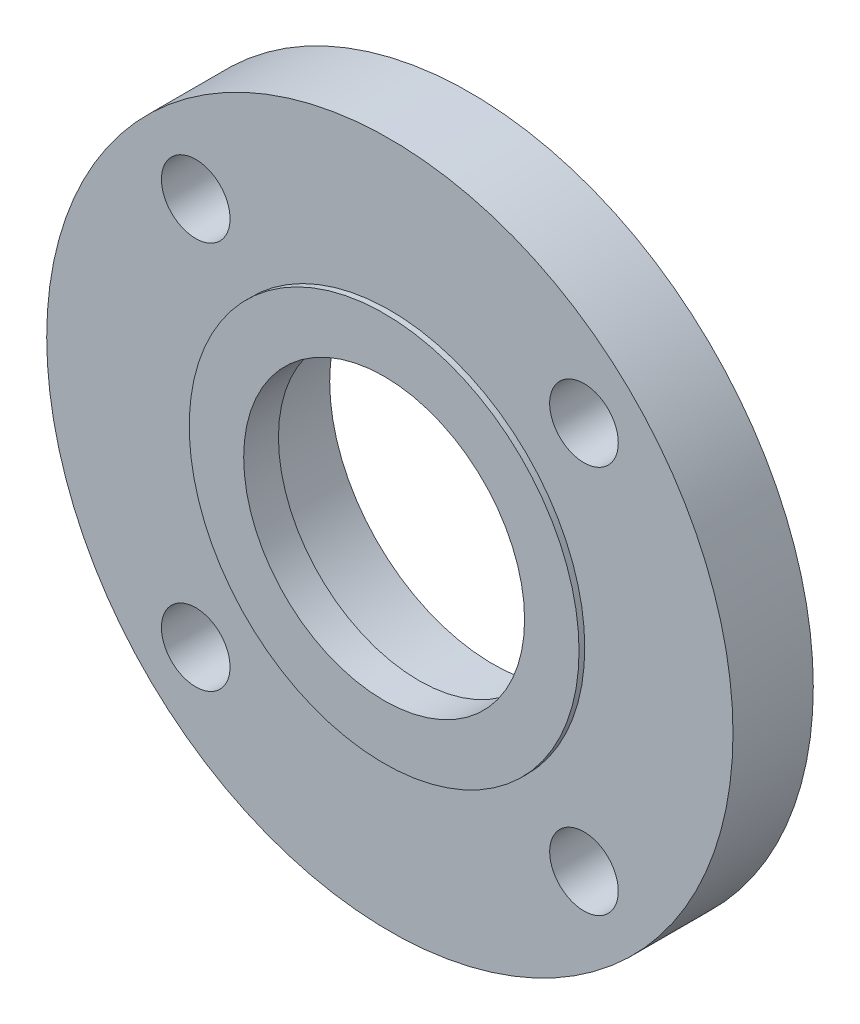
from build123d import *

# Parameters (mm, degrees)
HUB_DIAMETER_R          = 54.102
HUB_DEPTH               = 30.226
FLANGE_DIAMETER_R       = 95.25
FLANGE_DEPTH            = 22.2885
BOLT_DIAMETER_R         = 9.525
BOLT_HOLE_DEPTH         = 138.714518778
BOLT_HOLE_PATTERN_COUNT = 4
BOLT_HOLE_PATTERN_ANGLE = 270
SOCKET_DIAMETER_R       = 38.989
SOCKET_DEPTH            = 139.053381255
BORE_DIAMETER_R         = 45.339
BORE_DEPTH              = 20.574


with BuildPart() as part:
    # Hub Diameter → Hub (new body)
    with BuildSketch(Plane.XY):
        Circle(HUB_DIAMETER_R)
    extrude(amount=-HUB_DEPTH)

    # Flange Diameter → Flange (add)
    with BuildSketch(Plane.XY.offset(-1.5875)):
        Circle(FLANGE_DIAMETER_R)
    extrude(amount=-FLANGE_DEPTH)

    # Bolt Diameter → Bolt Hole (cut, through all)
    with BuildSketch(Plane.XY.offset(-1.5875)):
        with Locations((53.881536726, 53.881536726)):
            Circle(BOLT_DIAMETER_R)
    bolt_hole = extrude(amount=-BOLT_HOLE_DEPTH, mode=Mode.SUBTRACT)

    # Bolt Hole Pattern: Bolt Hole ×4 about axis
    bolt_hole_pattern_axis = Axis((0, 0, -50), (0, 0, 1))
    for i in range(1, BOLT_HOLE_PATTERN_COUNT):
        add(bolt_hole.rotate(bolt_hole_pattern_axis, i * BOLT_HOLE_PATTERN_ANGLE / (BOLT_HOLE_PATTERN_COUNT - 1)), mode=Mode.SUBTRACT)

    # Socket Diameter → Socket (cut, through all)
    with BuildSketch(Plane.XY):
        Circle(SOCKET_DIAMETER_R)
    extrude(amount=-SOCKET_DEPTH, mode=Mode.SUBTRACT)

    # Bore Diameter → Bore (cut)
    with BuildSketch(Plane(origin=(0, 0, -30.226), x_dir=(-1, 0, 0), z_dir=(0, 0, -1))):
        Circle(BORE_DIAMETER_R)
    extrude(amount=-BORE_DEPTH, mode=Mode.SUBTRACT)


solid = part.part
